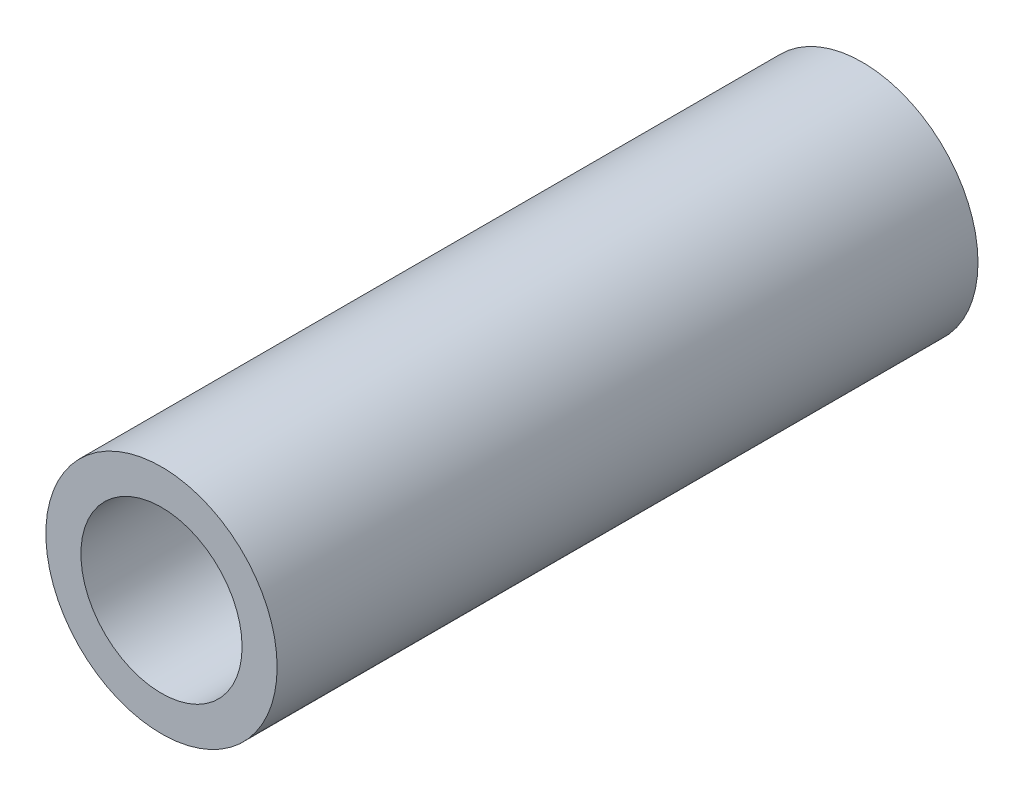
from build123d import *

# Parameters (mm, degrees)
SKETCH_1_R      = 33
SKETCH_1_R_2    = 23
EXTRUDE_1_DEPTH = 200


with BuildPart() as part:
    # Sketch 1 → Extrude 1 (new body)
    with BuildSketch(Plane.XY):
        Circle(SKETCH_1_R)
        Circle(SKETCH_1_R_2, mode=Mode.SUBTRACT)
    extrude(amount=EXTRUDE_1_DEPTH)


solid = part.part
